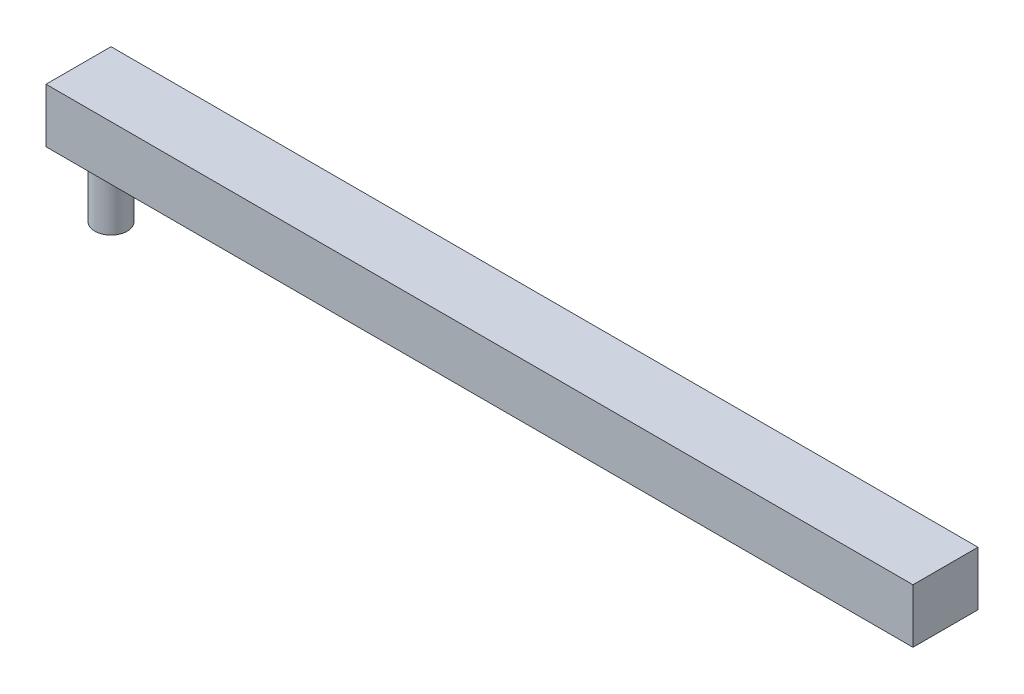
from build123d import *

# Parameters (mm, degrees)
BOSS_EXTRUDE1_DEPTH = 5
SKETCH2_R           = 1.5
BOSS_EXTRUDE2_DEPTH = 6


with BuildPart() as part:
    # Sketch1 → Boss-Extrude1 (new body)
    with BuildSketch(Plane(origin=(0, -6, 0), x_dir=(1, 0, 0), z_dir=(0, 1, 0))):
        Polygon((72.179420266, 0), (-2.820579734, 0), (-7.820579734, 0), (-7.820579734, 6), (72.179420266, 6), align=None)
    extrude(amount=BOSS_EXTRUDE1_DEPTH)

    # Sketch2 → Boss-Extrude2 (add)
    with BuildSketch(Plane.XZ.offset(6)):
        with Locations(Location((-4.820579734, -3, 0), (0, 0, 270))):
            Circle(SKETCH2_R)
    extrude(amount=BOSS_EXTRUDE2_DEPTH)


solid = part.part
